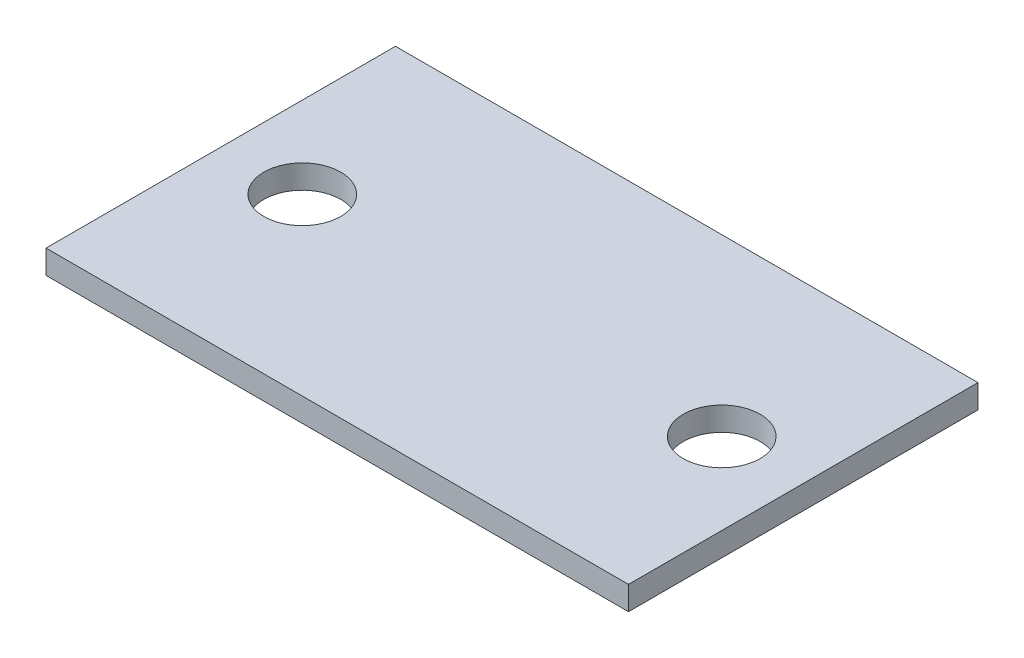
ISO-10303-21;
HEADER;
FILE_DESCRIPTION(('STEP AP214'),'2;1');
FILE_NAME('part.step','',(''),(''),'','','');
FILE_SCHEMA(('AUTOMOTIVE_DESIGN { 1 0 10303 214 1 1 1 1 }'));
ENDSEC;
DATA;
#1=APPLICATION_CONTEXT('core data for automotive mechanical design processes');
#2=APPLICATION_PROTOCOL_DEFINITION('international standard','automotive_design',2000,#1);
#3=PRODUCT_CONTEXT('',#1,'mechanical');
#4=PRODUCT('Part','Part','',(#3));
#5=PRODUCT_RELATED_PRODUCT_CATEGORY('part','',(#4));
#6=PRODUCT_DEFINITION_FORMATION('','',#4);
#7=PRODUCT_DEFINITION_CONTEXT('part definition',#1,'design');
#8=PRODUCT_DEFINITION('design','',#6,#7);
#9=PRODUCT_DEFINITION_SHAPE('','',#8);
#10=(LENGTH_UNIT() NAMED_UNIT(*) SI_UNIT(.MILLI.,.METRE.));
#11=(NAMED_UNIT(*) PLANE_ANGLE_UNIT() SI_UNIT($,.RADIAN.));
#12=(NAMED_UNIT(*) SI_UNIT($,.STERADIAN.) SOLID_ANGLE_UNIT());
#13=UNCERTAINTY_MEASURE_WITH_UNIT(LENGTH_MEASURE(1.E-05),#10,'distance_accuracy_value','');
#14=(GEOMETRIC_REPRESENTATION_CONTEXT(3) GLOBAL_UNCERTAINTY_ASSIGNED_CONTEXT((#13)) GLOBAL_UNIT_ASSIGNED_CONTEXT((#10,
#11,#12)) REPRESENTATION_CONTEXT('',''));
#15=CARTESIAN_POINT('',(0.,0.,0.));
#16=DIRECTION('',(0.,0.,1.));
#17=DIRECTION('',(1.,0.,0.));
#18=AXIS2_PLACEMENT_3D('',#15,#16,#17);
#19=CARTESIAN_POINT('',(25.,2.032,-15.));
#20=DIRECTION('',(-1.,0.,0.));
#21=DIRECTION('',(0.,0.,1.));
#22=AXIS2_PLACEMENT_3D('',#19,#20,#21);
#23=PLANE('',#22);
#24=DIRECTION('',(0.,0.,-1.));
#25=VECTOR('',#24,1.);
#26=CARTESIAN_POINT('',(25.,0.,-15.));
#27=LINE('',#26,#25);
#28=CARTESIAN_POINT('',(25.,0.,15.));
#29=VERTEX_POINT('',#28);
#30=CARTESIAN_POINT('',(25.,0.,-15.));
#31=VERTEX_POINT('',#30);
#32=EDGE_CURVE('E96',#29,#31,#27,.T.);
#33=ORIENTED_EDGE('',*,*,#32,.T.);
#34=DIRECTION('',(0.,-1.,0.));
#35=VECTOR('',#34,1.);
#36=CARTESIAN_POINT('',(25.,2.032,-15.));
#37=LINE('',#36,#35);
#38=CARTESIAN_POINT('',(25.,2.032,-15.));
#39=VERTEX_POINT('',#38);
#40=EDGE_CURVE('E11',#39,#31,#37,.T.);
#41=ORIENTED_EDGE('',*,*,#40,.F.);
#42=DIRECTION('',(0.,0.,-1.));
#43=VECTOR('',#42,1.);
#44=CARTESIAN_POINT('',(25.,2.032,-15.));
#45=LINE('',#44,#43);
#46=CARTESIAN_POINT('',(25.,2.032,15.));
#47=VERTEX_POINT('',#46);
#48=EDGE_CURVE('E84',#47,#39,#45,.T.);
#49=ORIENTED_EDGE('',*,*,#48,.F.);
#50=DIRECTION('',(0.,-1.,0.));
#51=VECTOR('',#50,1.);
#52=CARTESIAN_POINT('',(25.,2.032,15.));
#53=LINE('',#52,#51);
#54=EDGE_CURVE('E92',#47,#29,#53,.T.);
#55=ORIENTED_EDGE('',*,*,#54,.T.);
#56=EDGE_LOOP('',(#33,#41,#49,#55));
#57=FACE_BOUND('',#56,.T.);
#58=ADVANCED_FACE('F33',(#57),#23,.F.);
#59=CARTESIAN_POINT('',(-25.,2.032,-15.));
#60=DIRECTION('',(0.,0.,1.));
#61=DIRECTION('',(1.,0.,0.));
#62=AXIS2_PLACEMENT_3D('',#59,#60,#61);
#63=PLANE('',#62);
#64=DIRECTION('',(-1.,0.,0.));
#65=VECTOR('',#64,1.);
#66=CARTESIAN_POINT('',(-25.,0.,-15.));
#67=LINE('',#66,#65);
#68=CARTESIAN_POINT('',(-25.,0.,-15.));
#69=VERTEX_POINT('',#68);
#70=EDGE_CURVE('E88',#31,#69,#67,.T.);
#71=ORIENTED_EDGE('',*,*,#70,.T.);
#72=DIRECTION('',(0.,-1.,0.));
#73=VECTOR('',#72,1.);
#74=CARTESIAN_POINT('',(-25.,2.032,-15.));
#75=LINE('',#74,#73);
#76=CARTESIAN_POINT('',(-25.,2.032,-15.));
#77=VERTEX_POINT('',#76);
#78=EDGE_CURVE('E41',#77,#69,#75,.T.);
#79=ORIENTED_EDGE('',*,*,#78,.F.);
#80=DIRECTION('',(-1.,0.,0.));
#81=VECTOR('',#80,1.);
#82=CARTESIAN_POINT('',(-25.,2.032,-15.));
#83=LINE('',#82,#81);
#84=EDGE_CURVE('E79',#39,#77,#83,.T.);
#85=ORIENTED_EDGE('',*,*,#84,.F.);
#86=ORIENTED_EDGE('',*,*,#40,.T.);
#87=EDGE_LOOP('',(#71,#79,#85,#86));
#88=FACE_BOUND('',#87,.T.);
#89=ADVANCED_FACE('F87',(#88),#63,.F.);
#90=CARTESIAN_POINT('',(-25.,2.032,-15.));
#91=DIRECTION('',(1.,0.,0.));
#92=DIRECTION('',(0.,0.,-1.));
#93=AXIS2_PLACEMENT_3D('',#90,#91,#92);
#94=PLANE('',#93);
#95=DIRECTION('',(0.,0.,1.));
#96=VECTOR('',#95,1.);
#97=CARTESIAN_POINT('',(-25.,0.,-15.));
#98=LINE('',#97,#96);
#99=CARTESIAN_POINT('',(-25.,0.,15.));
#100=VERTEX_POINT('',#99);
#101=EDGE_CURVE('E66',#69,#100,#98,.T.);
#102=ORIENTED_EDGE('',*,*,#101,.T.);
#103=DIRECTION('',(0.,-1.,0.));
#104=VECTOR('',#103,1.);
#105=CARTESIAN_POINT('',(-25.,2.032,15.));
#106=LINE('',#105,#104);
#107=CARTESIAN_POINT('',(-25.,2.032,15.));
#108=VERTEX_POINT('',#107);
#109=EDGE_CURVE('E89',#108,#100,#106,.T.);
#110=ORIENTED_EDGE('',*,*,#109,.F.);
#111=DIRECTION('',(0.,0.,1.));
#112=VECTOR('',#111,1.);
#113=CARTESIAN_POINT('',(-25.,2.032,-15.));
#114=LINE('',#113,#112);
#115=EDGE_CURVE('E82',#77,#108,#114,.T.);
#116=ORIENTED_EDGE('',*,*,#115,.F.);
#117=ORIENTED_EDGE('',*,*,#78,.T.);
#118=EDGE_LOOP('',(#102,#110,#116,#117));
#119=FACE_BOUND('',#118,.T.);
#120=ADVANCED_FACE('F90',(#119),#94,.F.);
#121=CARTESIAN_POINT('',(-25.,2.032,15.));
#122=DIRECTION('',(0.,0.,-1.));
#123=DIRECTION('',(-1.,0.,0.));
#124=AXIS2_PLACEMENT_3D('',#121,#122,#123);
#125=PLANE('',#124);
#126=DIRECTION('',(1.,0.,0.));
#127=VECTOR('',#126,1.);
#128=CARTESIAN_POINT('',(-25.,0.,15.));
#129=LINE('',#128,#127);
#130=EDGE_CURVE('E72',#100,#29,#129,.T.);
#131=ORIENTED_EDGE('',*,*,#130,.T.);
#132=ORIENTED_EDGE('',*,*,#54,.F.);
#133=DIRECTION('',(1.,0.,0.));
#134=VECTOR('',#133,1.);
#135=CARTESIAN_POINT('',(-25.,2.032,15.));
#136=LINE('',#135,#134);
#137=EDGE_CURVE('E49',#108,#47,#136,.T.);
#138=ORIENTED_EDGE('',*,*,#137,.F.);
#139=ORIENTED_EDGE('',*,*,#109,.T.);
#140=EDGE_LOOP('',(#131,#132,#138,#139));
#141=FACE_BOUND('',#140,.T.);
#142=ADVANCED_FACE('F104',(#141),#125,.F.);
#143=CARTESIAN_POINT('',(0.,2.032,0.));
#144=DIRECTION('',(0.,1.,0.));
#145=DIRECTION('',(0.,0.,1.));
#146=AXIS2_PLACEMENT_3D('',#143,#144,#145);
#147=PLANE('',#146);
#148=CARTESIAN_POINT('',(-18.,2.032,0.));
#149=DIRECTION('',(0.,1.,0.));
#150=DIRECTION('',(0.,0.,-1.));
#151=AXIS2_PLACEMENT_3D('',#148,#149,#150);
#152=CIRCLE('',#151,3.3);
#153=CARTESIAN_POINT('',(-18.,2.032,-3.3));
#154=VERTEX_POINT('',#153);
#155=EDGE_CURVE('E116',#154,#154,#152,.T.);
#156=ORIENTED_EDGE('',*,*,#155,.F.);
#157=EDGE_LOOP('',(#156));
#158=FACE_BOUND('',#157,.T.);
#159=CARTESIAN_POINT('',(18.,2.032,0.));
#160=DIRECTION('',(0.,1.,0.));
#161=DIRECTION('',(0.,0.,1.));
#162=AXIS2_PLACEMENT_3D('',#159,#160,#161);
#163=CIRCLE('',#162,3.3);
#164=CARTESIAN_POINT('',(18.,2.032,3.3));
#165=VERTEX_POINT('',#164);
#166=EDGE_CURVE('E110',#165,#165,#163,.T.);
#167=ORIENTED_EDGE('',*,*,#166,.F.);
#168=EDGE_LOOP('',(#167));
#169=FACE_BOUND('',#168,.T.);
#170=ORIENTED_EDGE('',*,*,#48,.T.);
#171=ORIENTED_EDGE('',*,*,#84,.T.);
#172=ORIENTED_EDGE('',*,*,#115,.T.);
#173=ORIENTED_EDGE('',*,*,#137,.T.);
#174=EDGE_LOOP('',(#170,#171,#172,#173));
#175=FACE_BOUND('',#174,.T.);
#176=ADVANCED_FACE('F80',(#158,#169,#175),#147,.T.);
#177=CARTESIAN_POINT('',(0.,0.,0.));
#178=DIRECTION('',(0.,1.,0.));
#179=DIRECTION('',(0.,0.,1.));
#180=AXIS2_PLACEMENT_3D('',#177,#178,#179);
#181=PLANE('',#180);
#182=CARTESIAN_POINT('',(-18.,0.,0.));
#183=DIRECTION('',(0.,1.,0.));
#184=DIRECTION('',(0.,0.,-1.));
#185=AXIS2_PLACEMENT_3D('',#182,#183,#184);
#186=CIRCLE('',#185,3.3);
#187=CARTESIAN_POINT('',(-18.,0.,-3.3));
#188=VERTEX_POINT('',#187);
#189=EDGE_CURVE('E113',#188,#188,#186,.T.);
#190=ORIENTED_EDGE('',*,*,#189,.T.);
#191=EDGE_LOOP('',(#190));
#192=FACE_BOUND('',#191,.T.);
#193=CARTESIAN_POINT('',(18.,0.,0.));
#194=DIRECTION('',(0.,1.,0.));
#195=DIRECTION('',(0.,0.,1.));
#196=AXIS2_PLACEMENT_3D('',#193,#194,#195);
#197=CIRCLE('',#196,3.3);
#198=CARTESIAN_POINT('',(18.,0.,3.3));
#199=VERTEX_POINT('',#198);
#200=EDGE_CURVE('E99',#199,#199,#197,.T.);
#201=ORIENTED_EDGE('',*,*,#200,.T.);
#202=EDGE_LOOP('',(#201));
#203=FACE_BOUND('',#202,.T.);
#204=ORIENTED_EDGE('',*,*,#32,.F.);
#205=ORIENTED_EDGE('',*,*,#130,.F.);
#206=ORIENTED_EDGE('',*,*,#101,.F.);
#207=ORIENTED_EDGE('',*,*,#70,.F.);
#208=EDGE_LOOP('',(#204,#205,#206,#207));
#209=FACE_BOUND('',#208,.T.);
#210=ADVANCED_FACE('F107',(#192,#203,#209),#181,.F.);
#211=CARTESIAN_POINT('',(18.,0.,0.));
#212=DIRECTION('',(0.,1.,0.));
#213=DIRECTION('',(0.,0.,1.));
#214=AXIS2_PLACEMENT_3D('',#211,#212,#213);
#215=CYLINDRICAL_SURFACE('',#214,3.3);
#216=ORIENTED_EDGE('',*,*,#200,.F.);
#217=EDGE_LOOP('',(#216));
#218=FACE_BOUND('',#217,.T.);
#219=ORIENTED_EDGE('',*,*,#166,.T.);
#220=EDGE_LOOP('',(#219));
#221=FACE_BOUND('',#220,.T.);
#222=ADVANCED_FACE('F127',(#218,#221),#215,.F.);
#223=CARTESIAN_POINT('',(-18.,0.,0.));
#224=DIRECTION('',(0.,1.,0.));
#225=DIRECTION('',(0.,0.,1.));
#226=AXIS2_PLACEMENT_3D('',#223,#224,#225);
#227=CYLINDRICAL_SURFACE('',#226,3.3);
#228=ORIENTED_EDGE('',*,*,#189,.F.);
#229=EDGE_LOOP('',(#228));
#230=FACE_BOUND('',#229,.T.);
#231=ORIENTED_EDGE('',*,*,#155,.T.);
#232=EDGE_LOOP('',(#231));
#233=FACE_BOUND('',#232,.T.);
#234=ADVANCED_FACE('F124',(#230,#233),#227,.F.);
#235=CLOSED_SHELL('',(#58,#89,#120,#142,#176,#210,#222,#234));
#236=MANIFOLD_SOLID_BREP('B2',#235);
#237=ADVANCED_BREP_SHAPE_REPRESENTATION('',(#18,#236),#14);
#238=SHAPE_DEFINITION_REPRESENTATION(#9,#237);
ENDSEC;
END-ISO-10303-21;
